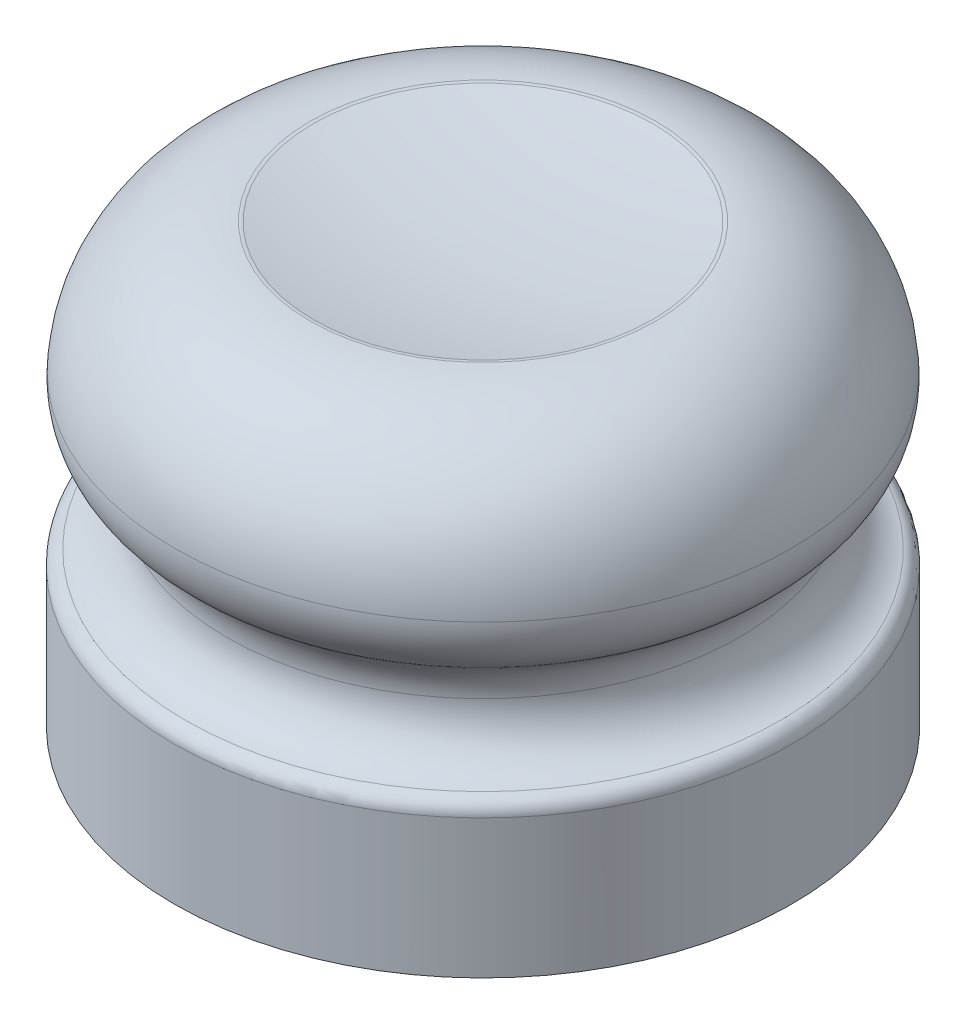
ISO-10303-21;
HEADER;
FILE_DESCRIPTION(('STEP AP214'),'2;1');
FILE_NAME('part.step','',(''),(''),'','','');
FILE_SCHEMA(('AUTOMOTIVE_DESIGN { 1 0 10303 214 1 1 1 1 }'));
ENDSEC;
DATA;
#1=APPLICATION_CONTEXT('core data for automotive mechanical design processes');
#2=APPLICATION_PROTOCOL_DEFINITION('international standard','automotive_design',2000,#1);
#3=PRODUCT_CONTEXT('',#1,'mechanical');
#4=PRODUCT('Part','Part','',(#3));
#5=PRODUCT_RELATED_PRODUCT_CATEGORY('part','',(#4));
#6=PRODUCT_DEFINITION_FORMATION('','',#4);
#7=PRODUCT_DEFINITION_CONTEXT('part definition',#1,'design');
#8=PRODUCT_DEFINITION('design','',#6,#7);
#9=PRODUCT_DEFINITION_SHAPE('','',#8);
#10=(LENGTH_UNIT() NAMED_UNIT(*) SI_UNIT(.MILLI.,.METRE.));
#11=(NAMED_UNIT(*) PLANE_ANGLE_UNIT() SI_UNIT($,.RADIAN.));
#12=(NAMED_UNIT(*) SI_UNIT($,.STERADIAN.) SOLID_ANGLE_UNIT());
#13=UNCERTAINTY_MEASURE_WITH_UNIT(LENGTH_MEASURE(1.E-05),#10,'distance_accuracy_value','');
#14=(GEOMETRIC_REPRESENTATION_CONTEXT(3) GLOBAL_UNCERTAINTY_ASSIGNED_CONTEXT((#13)) GLOBAL_UNIT_ASSIGNED_CONTEXT((#10,
#11,#12)) REPRESENTATION_CONTEXT('',''));
#15=CARTESIAN_POINT('',(0.,0.,0.));
#16=DIRECTION('',(0.,0.,1.));
#17=DIRECTION('',(1.,0.,0.));
#18=AXIS2_PLACEMENT_3D('',#15,#16,#17);
#19=CARTESIAN_POINT('',(0.,207.638797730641,0.));
#20=DIRECTION('',(0.,0.,1.));
#21=DIRECTION('',(1.,0.,0.));
#22=AXIS2_PLACEMENT_3D('',#19,#20,#21);
#23=SPHERICAL_SURFACE('',#22,137.69188121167);
#24=CARTESIAN_POINT('',(0.,207.638797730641,0.));
#25=DIRECTION('',(0.,1.,0.));
#26=DIRECTION('',(0.,0.,1.));
#27=AXIS2_PLACEMENT_3D('',#24,#25,#26);
#28=SPHERICAL_SURFACE('',#27,137.69188121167);
#29=CARTESIAN_POINT('',(0.,72.891869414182,0.));
#30=DIRECTION('',(0.,1.,0.));
#31=DIRECTION('',(0.,0.,1.));
#32=AXIS2_PLACEMENT_3D('',#29,#30,#31);
#33=CIRCLE('',#32,28.325244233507);
#34=CARTESIAN_POINT('',(0.,72.891869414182,28.325244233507));
#35=VERTEX_POINT('',#34);
#36=EDGE_CURVE('E38',#35,#35,#33,.T.);
#37=ORIENTED_EDGE('',*,*,#36,.T.);
#38=EDGE_LOOP('',(#37));
#39=FACE_BOUND('',#38,.T.);
#40=ADVANCED_FACE('F31',(#39),#28,.F.);
#41=CARTESIAN_POINT('',(0.,50.0451014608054,0.));
#42=DIRECTION('',(0.,1.,0.));
#43=DIRECTION('',(0.,0.,1.));
#44=AXIS2_PLACEMENT_3D('',#41,#42,#43);
#45=TOROIDAL_SURFACE('',#44,28.585858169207,22.9018150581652);
#46=CARTESIAN_POINT('',(0.,72.9451461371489,0.));
#47=DIRECTION('',(0.,-1.,0.));
#48=DIRECTION('',(0.,0.,-1.));
#49=AXIS2_PLACEMENT_3D('',#46,#47,#48);
#50=CIRCLE('',#49,28.8706155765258);
#51=CARTESIAN_POINT('',(0.,72.9451461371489,-28.8706155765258));
#52=VERTEX_POINT('',#51);
#53=EDGE_CURVE('E10',#52,#52,#50,.T.);
#54=ORIENTED_EDGE('',*,*,#53,.T.);
#55=EDGE_LOOP('',(#54));
#56=FACE_BOUND('',#55,.T.);
#57=CARTESIAN_POINT('',(0.,51.3637588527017,0.));
#58=DIRECTION('',(0.,1.,0.));
#59=DIRECTION('',(0.,0.,1.));
#60=AXIS2_PLACEMENT_3D('',#57,#58,#59);
#61=CIRCLE('',#60,51.4496784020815);
#62=CARTESIAN_POINT('',(0.,51.3637588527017,51.4496784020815));
#63=VERTEX_POINT('',#62);
#64=EDGE_CURVE('E51',#63,#63,#61,.T.);
#65=ORIENTED_EDGE('',*,*,#64,.T.);
#66=EDGE_LOOP('',(#65));
#67=FACE_BOUND('',#66,.T.);
#68=ADVANCED_FACE('F79',(#56,#67),#45,.T.);
#69=CARTESIAN_POINT('',(0.,50.7047429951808,0.));
#70=DIRECTION('',(0.,1.,0.));
#71=DIRECTION('',(0.,0.,1.));
#72=AXIS2_PLACEMENT_3D('',#69,#70,#71);
#73=TOROIDAL_SURFACE('',#72,40.0231925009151,11.4454742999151);
#74=ORIENTED_EDGE('',*,*,#64,.F.);
#75=EDGE_LOOP('',(#74));
#76=FACE_BOUND('',#75,.T.);
#77=CARTESIAN_POINT('',(0.,41.2843235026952,0.));
#78=DIRECTION('',(0.,1.,0.));
#79=DIRECTION('',(0.,0.,1.));
#80=AXIS2_PLACEMENT_3D('',#77,#78,#79);
#81=CIRCLE('',#80,46.5235446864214);
#82=CARTESIAN_POINT('',(0.,41.2843235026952,46.5235446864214));
#83=VERTEX_POINT('',#82);
#84=EDGE_CURVE('E54',#83,#83,#81,.T.);
#85=ORIENTED_EDGE('',*,*,#84,.T.);
#86=EDGE_LOOP('',(#85));
#87=FACE_BOUND('',#86,.T.);
#88=ADVANCED_FACE('F84',(#76,#87),#73,.T.);
#89=CARTESIAN_POINT('',(0.,34.1452878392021,0.));
#90=DIRECTION('',(0.,1.,0.));
#91=DIRECTION('',(0.,0.,1.));
#92=AXIS2_PLACEMENT_3D('',#89,#90,#91);
#93=TOROIDAL_SURFACE('',#92,51.4496784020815,8.67367416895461);
#94=ORIENTED_EDGE('',*,*,#84,.F.);
#95=EDGE_LOOP('',(#94));
#96=FACE_BOUND('',#95,.T.);
#97=CARTESIAN_POINT('',(0.,34.1770293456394,0.));
#98=DIRECTION('',(0.,1.,0.));
#99=DIRECTION('',(0.,0.,1.));
#100=AXIS2_PLACEMENT_3D('',#97,#98,#99);
#101=CIRCLE('',#100,42.776062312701);
#102=CARTESIAN_POINT('',(0.,34.1770293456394,42.776062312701));
#103=VERTEX_POINT('',#102);
#104=EDGE_CURVE('E57',#103,#103,#101,.T.);
#105=ORIENTED_EDGE('',*,*,#104,.T.);
#106=EDGE_LOOP('',(#105));
#107=FACE_BOUND('',#106,.T.);
#108=ADVANCED_FACE('F89',(#96,#107),#93,.F.);
#109=CARTESIAN_POINT('',(0.,34.1448251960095,0.));
#110=DIRECTION('',(0.,1.,0.));
#111=DIRECTION('',(0.,0.,1.));
#112=AXIS2_PLACEMENT_3D('',#109,#110,#111);
#113=TOROIDAL_SURFACE('',#112,51.5760992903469,8.80009590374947);
#114=CARTESIAN_POINT('',(0.,25.5685231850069,0.));
#115=DIRECTION('',(0.,1.,0.));
#116=DIRECTION('',(0.,0.,1.));
#117=AXIS2_PLACEMENT_3D('',#114,#115,#116);
#118=CIRCLE('',#117,49.6041125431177);
#119=CARTESIAN_POINT('',(0.,25.5685231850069,49.6041125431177));
#120=VERTEX_POINT('',#119);
#121=EDGE_CURVE('E46',#120,#120,#118,.T.);
#122=ORIENTED_EDGE('',*,*,#121,.T.);
#123=EDGE_LOOP('',(#122));
#124=FACE_BOUND('',#123,.T.);
#125=ORIENTED_EDGE('',*,*,#104,.F.);
#126=EDGE_LOOP('',(#125));
#127=FACE_BOUND('',#126,.T.);
#128=ADVANCED_FACE('F75',(#124,#127),#113,.F.);
#129=CARTESIAN_POINT('',(0.,72.9469165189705,0.));
#130=DIRECTION('',(0.,1.,0.));
#131=DIRECTION('',(0.,0.,1.));
#132=AXIS2_PLACEMENT_3D('',#129,#130,#131);
#133=CYLINDRICAL_SURFACE('',#132,51.543895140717);
#134=CARTESIAN_POINT('',(0.,23.1321003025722,0.));
#135=DIRECTION('',(0.,-1.,0.));
#136=DIRECTION('',(0.,0.,-1.));
#137=AXIS2_PLACEMENT_3D('',#134,#135,#136);
#138=CIRCLE('',#137,51.543895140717);
#139=CARTESIAN_POINT('',(0.,23.1321003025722,-51.543895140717));
#140=VERTEX_POINT('',#139);
#141=EDGE_CURVE('E42',#140,#140,#138,.T.);
#142=ORIENTED_EDGE('',*,*,#141,.T.);
#143=EDGE_LOOP('',(#142));
#144=FACE_BOUND('',#143,.T.);
#145=CARTESIAN_POINT('',(0.,0.,0.));
#146=DIRECTION('',(0.,1.,0.));
#147=DIRECTION('',(0.,0.,1.));
#148=AXIS2_PLACEMENT_3D('',#145,#146,#147);
#149=CIRCLE('',#148,51.543895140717);
#150=CARTESIAN_POINT('',(0.,0.,51.543895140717));
#151=VERTEX_POINT('',#150);
#152=EDGE_CURVE('E60',#151,#151,#149,.T.);
#153=ORIENTED_EDGE('',*,*,#152,.T.);
#154=EDGE_LOOP('',(#153));
#155=FACE_BOUND('',#154,.T.);
#156=ADVANCED_FACE('F64',(#144,#155),#133,.T.);
#157=CARTESIAN_POINT('',(0.,0.,0.));
#158=DIRECTION('',(0.,1.,0.));
#159=DIRECTION('',(0.,0.,1.));
#160=AXIS2_PLACEMENT_3D('',#157,#158,#159);
#161=PLANE('',#160);
#162=ORIENTED_EDGE('',*,*,#152,.F.);
#163=EDGE_LOOP('',(#162));
#164=FACE_BOUND('',#163,.T.);
#165=ADVANCED_FACE('F66',(#164),#161,.F.);
#166=CARTESIAN_POINT('',(0.,23.1321003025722,0.));
#167=DIRECTION('',(0.,-1.,0.));
#168=DIRECTION('',(0.,0.,-1.));
#169=AXIS2_PLACEMENT_3D('',#166,#167,#168);
#170=TOROIDAL_SURFACE('',#169,49.043895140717,2.5);
#171=ORIENTED_EDGE('',*,*,#141,.F.);
#172=EDGE_LOOP('',(#171));
#173=FACE_BOUND('',#172,.T.);
#174=ORIENTED_EDGE('',*,*,#121,.F.);
#175=EDGE_LOOP('',(#174));
#176=FACE_BOUND('',#175,.T.);
#177=ADVANCED_FACE('F68',(#173,#176),#170,.T.);
#178=CARTESIAN_POINT('',(0.,70.4453393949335,0.));
#179=DIRECTION('',(0.,1.,0.));
#180=DIRECTION('',(0.,0.,1.));
#181=AXIS2_PLACEMENT_3D('',#178,#179,#180);
#182=TOROIDAL_SURFACE('',#181,28.839530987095,2.5);
#183=ORIENTED_EDGE('',*,*,#53,.F.);
#184=EDGE_LOOP('',(#183));
#185=FACE_BOUND('',#184,.T.);
#186=ORIENTED_EDGE('',*,*,#36,.F.);
#187=EDGE_LOOP('',(#186));
#188=FACE_BOUND('',#187,.T.);
#189=ADVANCED_FACE('F33',(#185,#188),#182,.T.);
#190=CLOSED_SHELL('',(#40,#68,#88,#108,#128,#156,#165,#177,#189));
#191=MANIFOLD_SOLID_BREP('B2',#190);
#192=ADVANCED_BREP_SHAPE_REPRESENTATION('',(#18,#191),#14);
#193=SHAPE_DEFINITION_REPRESENTATION(#9,#192);
ENDSEC;
END-ISO-10303-21;
